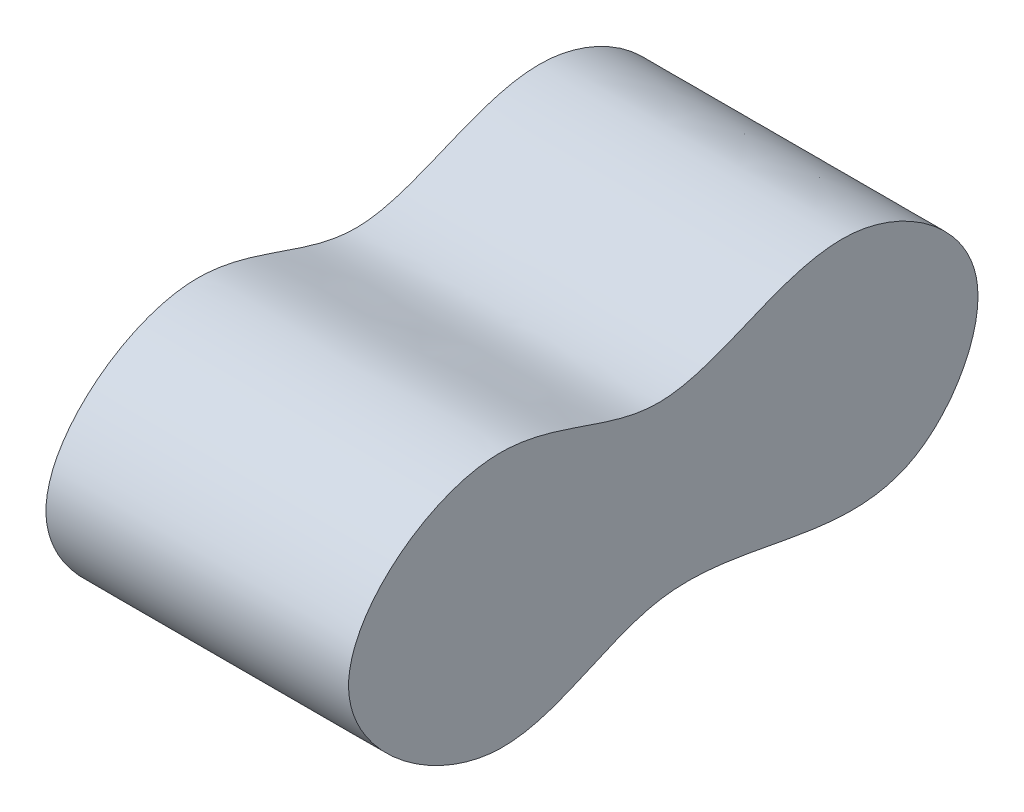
ISO-10303-21;
HEADER;
FILE_DESCRIPTION(('STEP AP214'),'2;1');
FILE_NAME('part.step','',(''),(''),'','','');
FILE_SCHEMA(('AUTOMOTIVE_DESIGN { 1 0 10303 214 1 1 1 1 }'));
ENDSEC;
DATA;
#1=APPLICATION_CONTEXT('core data for automotive mechanical design processes');
#2=APPLICATION_PROTOCOL_DEFINITION('international standard','automotive_design',2000,#1);
#3=PRODUCT_CONTEXT('',#1,'mechanical');
#4=PRODUCT('Part','Part','',(#3));
#5=PRODUCT_RELATED_PRODUCT_CATEGORY('part','',(#4));
#6=PRODUCT_DEFINITION_FORMATION('','',#4);
#7=PRODUCT_DEFINITION_CONTEXT('part definition',#1,'design');
#8=PRODUCT_DEFINITION('design','',#6,#7);
#9=PRODUCT_DEFINITION_SHAPE('','',#8);
#10=(LENGTH_UNIT() NAMED_UNIT(*) SI_UNIT(.MILLI.,.METRE.));
#11=(NAMED_UNIT(*) PLANE_ANGLE_UNIT() SI_UNIT($,.RADIAN.));
#12=(NAMED_UNIT(*) SI_UNIT($,.STERADIAN.) SOLID_ANGLE_UNIT());
#13=UNCERTAINTY_MEASURE_WITH_UNIT(LENGTH_MEASURE(1.E-05),#10,'distance_accuracy_value','');
#14=(GEOMETRIC_REPRESENTATION_CONTEXT(3) GLOBAL_UNCERTAINTY_ASSIGNED_CONTEXT((#13)) GLOBAL_UNIT_ASSIGNED_CONTEXT((#10,
#11,#12)) REPRESENTATION_CONTEXT('',''));
#15=CARTESIAN_POINT('',(0.,0.,0.));
#16=DIRECTION('',(0.,0.,1.));
#17=DIRECTION('',(1.,0.,0.));
#18=AXIS2_PLACEMENT_3D('',#15,#16,#17);
#19=CARTESIAN_POINT('',(50.,47.6773355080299,56.039206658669));
#20=CARTESIAN_POINT('',(50.,45.9155623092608,78.0126165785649));
#21=CARTESIAN_POINT('',(50.,5.56543937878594,128.411444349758));
#22=CARTESIAN_POINT('',(50.,-53.9002459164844,52.9596717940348));
#23=CARTESIAN_POINT('',(50.,-2.66117095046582,-6.07289836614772));
#24=CARTESIAN_POINT('',(50.,-46.4326883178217,-78.8495734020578));
#25=CARTESIAN_POINT('',(50.,23.7538941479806,-118.878466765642));
#26=CARTESIAN_POINT('',(50.,69.0983812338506,-57.6850655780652));
#27=CARTESIAN_POINT('',(50.,20.3127880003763,-2.76683640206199));
#28=CARTESIAN_POINT('',(50.,49.2951085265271,35.861813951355));
#29=CARTESIAN_POINT('',(50.,47.6773355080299,56.039206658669));
#30=B_SPLINE_CURVE_WITH_KNOTS('',3,(#19,#20,#21,#22,#23,#24,#25,#26,#27,#28,#29),.UNSPECIFIED.,
.T.,.F.,(4,1,1,1,1,1,1,1,4),(0.,0.12733600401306,0.261095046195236,0.375018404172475,
0.549386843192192,0.638619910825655,0.748787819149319,0.883071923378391,1.),.UNSPECIFIED.);
#31=DIRECTION('',(-1.,0.,0.));
#32=VECTOR('',#31,1.);
#33=SURFACE_OF_LINEAR_EXTRUSION('',#30,#32);
#34=CARTESIAN_POINT('',(50.,47.6773355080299,56.039206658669));
#35=VERTEX_POINT('',#34);
#36=EDGE_CURVE('E10',#35,#35,#30,.T.);
#37=ORIENTED_EDGE('',*,*,#36,.F.);
#38=EDGE_LOOP('',(#37));
#39=FACE_BOUND('',#38,.T.);
#40=CARTESIAN_POINT('',(-50.,47.6773355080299,56.039206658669));
#41=CARTESIAN_POINT('',(-50.,45.9155623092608,78.0126165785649));
#42=CARTESIAN_POINT('',(-50.,5.56543937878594,128.411444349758));
#43=CARTESIAN_POINT('',(-50.,-53.9002459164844,52.9596717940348));
#44=CARTESIAN_POINT('',(-50.,-2.66117095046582,-6.07289836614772));
#45=CARTESIAN_POINT('',(-50.,-46.4326883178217,-78.8495734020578));
#46=CARTESIAN_POINT('',(-50.,23.7538941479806,-118.878466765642));
#47=CARTESIAN_POINT('',(-50.,69.0983812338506,-57.6850655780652));
#48=CARTESIAN_POINT('',(-50.,20.3127880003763,-2.76683640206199));
#49=CARTESIAN_POINT('',(-50.,49.2951085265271,35.861813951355));
#50=CARTESIAN_POINT('',(-50.,47.6773355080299,56.039206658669));
#51=B_SPLINE_CURVE_WITH_KNOTS('',3,(#40,#41,#42,#43,#44,#45,#46,#47,#48,#49,#50),.UNSPECIFIED.,
.T.,.F.,(4,1,1,1,1,1,1,1,4),(0.,0.12733600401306,0.261095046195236,0.375018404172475,
0.549386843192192,0.638619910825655,0.748787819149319,0.883071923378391,1.),.UNSPECIFIED.);
#52=CARTESIAN_POINT('',(-50.,47.6773355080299,56.039206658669));
#53=VERTEX_POINT('',#52);
#54=EDGE_CURVE('E34',#53,#53,#51,.T.);
#55=ORIENTED_EDGE('',*,*,#54,.T.);
#56=EDGE_LOOP('',(#55));
#57=FACE_BOUND('',#56,.T.);
#58=ADVANCED_FACE('F30',(#39,#57),#33,.F.);
#59=CARTESIAN_POINT('',(50.,-26.7937406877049,-63.1876970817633));
#60=DIRECTION('',(-1.,0.,0.));
#61=DIRECTION('',(0.,0.,1.));
#62=AXIS2_PLACEMENT_3D('',#59,#60,#61);
#63=PLANE('',#62);
#64=ORIENTED_EDGE('',*,*,#36,.T.);
#65=EDGE_LOOP('',(#64));
#66=FACE_BOUND('',#65,.T.);
#67=ADVANCED_FACE('F53',(#66),#63,.F.);
#68=CARTESIAN_POINT('',(-50.,-26.7937406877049,-63.1876970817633));
#69=DIRECTION('',(-1.,0.,0.));
#70=DIRECTION('',(0.,0.,1.));
#71=AXIS2_PLACEMENT_3D('',#68,#69,#70);
#72=PLANE('',#71);
#73=ORIENTED_EDGE('',*,*,#54,.F.);
#74=EDGE_LOOP('',(#73));
#75=FACE_BOUND('',#74,.T.);
#76=ADVANCED_FACE('F51',(#75),#72,.T.);
#77=CLOSED_SHELL('',(#58,#67,#76));
#78=MANIFOLD_SOLID_BREP('B2',#77);
#79=ADVANCED_BREP_SHAPE_REPRESENTATION('',(#18,#78),#14);
#80=SHAPE_DEFINITION_REPRESENTATION(#9,#79);
ENDSEC;
END-ISO-10303-21;
